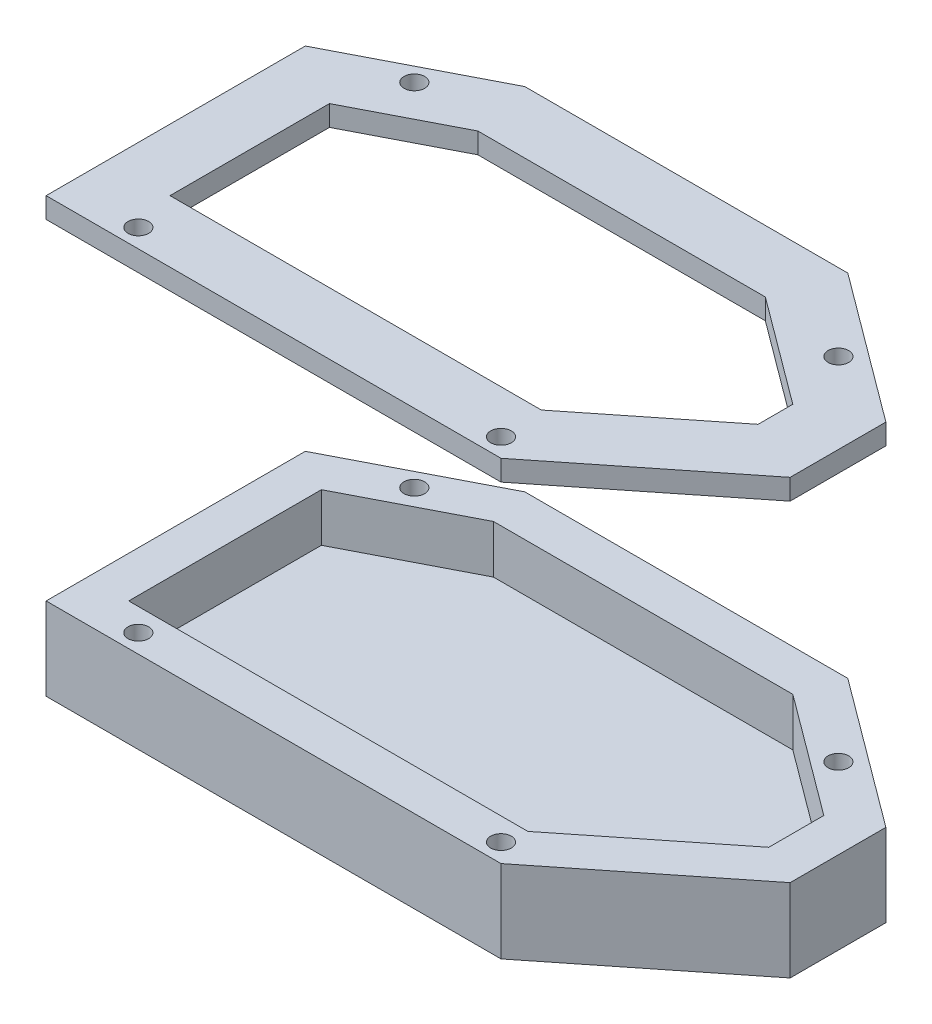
from build123d import *

# Parameters (mm, degrees)
BOSS_EXTRUDE1_DEPTH      = 5
BOSS_EXTRUDE2_DEPTH      = 7
BOSS_EXTRUDE2_DEPTH_BACK = 5
SKETCH4_R                = 1.5
CUT_EXTRUDE1_DEPTH       = 95.458985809
SKETCH5_R                = 1.5
BOSS_EXTRUDE3_DEPTH      = 3


with BuildPart() as part:
    # Sketch1 → Boss-Extrude1 (new body)
    with BuildSketch(Plane(origin=(0, 0, 0), x_dir=(1, 0, 0), z_dir=(0, 1, 0))):
        Polygon((0, 0), (0, 28), (16.5, 36.5), (60, 36.5), (77.5, 23.5), (77.5, 15.5), (58, 0), align=None)
    extrude(amount=BOSS_EXTRUDE1_DEPTH)

    # Sketch2 → Boss-Extrude2 (add, two sides: drawn at the far end of the back side and taken through both)
    with BuildSketch(Plane(origin=(0, 5, 0), x_dir=(1, 0, 0), z_dir=(0, 1, 0)).offset(-BOSS_EXTRUDE2_DEPTH_BACK)):
        Polygon((-6, -6), (60.094130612, -6), (83.5, 12.604665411), (83.5, 26.517221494), (61.984721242, 42.5), (15.045380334, 42.5), (-6, 31.658440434), align=None)
        Polygon((0, 28), (0, 0), (58, 0), (77.5, 15.5), (77.5, 23.5), (60, 36.5), (16.5, 36.5), align=None, mode=Mode.SUBTRACT)
    extrude(amount=BOSS_EXTRUDE2_DEPTH + BOSS_EXTRUDE2_DEPTH_BACK)

    # Sketch4 → Cut-Extrude1 (cut, through all)
    with BuildSketch(Plane(origin=(0, 12, 0), x_dir=(1, 0, 0), z_dir=(0, 1, 0))):
        with Locations(Location((6.5, 35, 0), (0, 0, 270))):
            Circle(SKETCH4_R)
        with Locations(Location((71.8, 31.317221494, 0), (0, 0, 270))):
            Circle(SKETCH4_R)
        with Locations(Location((4.7, -3.3, 0), (0, 0, 270))):
            Circle(SKETCH4_R)
        with Locations(Location((57.394130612, -3.3, 0), (0, 0, 270))):
            Circle(SKETCH4_R)
    extrude(amount=-CUT_EXTRUDE1_DEPTH, mode=Mode.SUBTRACT)


with BuildPart() as body_2:
    # Sketch5 → Boss-Extrude3 (new body)
    with BuildSketch(Plane(origin=(0, 60, 0), x_dir=(1, 0, 0), z_dir=(0, 1, 0))):
        Polygon((-6, 31.658440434), (-6, -6), (60.094130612, -6), (83.5, 12.604665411), (83.5, 26.517221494), (61.984721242, 42.5), (15.045380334, 42.5), align=None)
        with Locations(Location((6.5, 35, 0), (0, 0, 270))):
            Circle(SKETCH5_R, mode=Mode.SUBTRACT)
        with Locations(Location((4.7, -3.3, 0), (0, 0, 270))):
            Circle(SKETCH5_R, mode=Mode.SUBTRACT)
        with Locations(Location((57.394130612, -3.3, 0), (0, 0, 270))):
            Circle(SKETCH5_R, mode=Mode.SUBTRACT)
        with Locations(Location((71.8, 31.317221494, 0), (0, 0, 270))):
            Circle(SKETCH5_R, mode=Mode.SUBTRACT)
        Polygon((3, 26.170779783), (3, 3), (56.952934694, 3), (74.5, 16.947667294), (74.5, 21.991389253), (59.007639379, 33.5), (17.227309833, 33.5), align=None, mode=Mode.SUBTRACT)
    extrude(amount=BOSS_EXTRUDE3_DEPTH)


solid = Compound([part.part, body_2.part])
